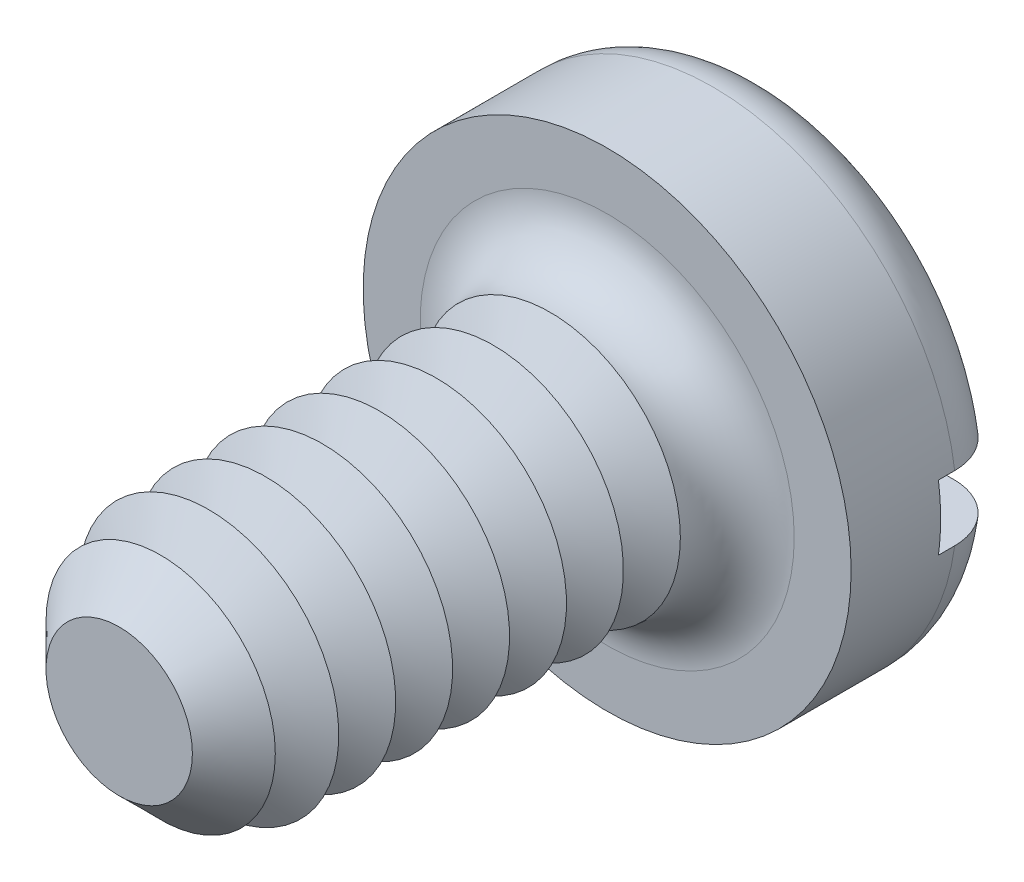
ISO-10303-21;
HEADER;
FILE_DESCRIPTION(('STEP AP214'),'2;1');
FILE_NAME('part.step','',(''),(''),'','','');
FILE_SCHEMA(('AUTOMOTIVE_DESIGN { 1 0 10303 214 1 1 1 1 }'));
ENDSEC;
DATA;
#1=APPLICATION_CONTEXT('core data for automotive mechanical design processes');
#2=APPLICATION_PROTOCOL_DEFINITION('international standard','automotive_design',2000,#1);
#3=PRODUCT_CONTEXT('',#1,'mechanical');
#4=PRODUCT('Part','Part','',(#3));
#5=PRODUCT_RELATED_PRODUCT_CATEGORY('part','',(#4));
#6=PRODUCT_DEFINITION_FORMATION('','',#4);
#7=PRODUCT_DEFINITION_CONTEXT('part definition',#1,'design');
#8=PRODUCT_DEFINITION('design','',#6,#7);
#9=PRODUCT_DEFINITION_SHAPE('','',#8);
#10=(LENGTH_UNIT() NAMED_UNIT(*) SI_UNIT(.MILLI.,.METRE.));
#11=(NAMED_UNIT(*) PLANE_ANGLE_UNIT() SI_UNIT($,.RADIAN.));
#12=(NAMED_UNIT(*) SI_UNIT($,.STERADIAN.) SOLID_ANGLE_UNIT());
#13=UNCERTAINTY_MEASURE_WITH_UNIT(LENGTH_MEASURE(1.E-05),#10,'distance_accuracy_value','');
#14=(GEOMETRIC_REPRESENTATION_CONTEXT(3) GLOBAL_UNCERTAINTY_ASSIGNED_CONTEXT((#13)) GLOBAL_UNIT_ASSIGNED_CONTEXT((#10,
#11,#12)) REPRESENTATION_CONTEXT('',''));
#15=CARTESIAN_POINT('',(0.,0.,0.));
#16=DIRECTION('',(0.,0.,1.));
#17=DIRECTION('',(1.,0.,0.));
#18=AXIS2_PLACEMENT_3D('',#15,#16,#17);
#19=CARTESIAN_POINT('',(0.,0.,-1.));
#20=DIRECTION('',(0.,0.,1.));
#21=DIRECTION('',(1.,0.,0.));
#22=AXIS2_PLACEMENT_3D('',#19,#20,#21);
#23=PLANE('',#22);
#24=CARTESIAN_POINT('',(0.,0.,-1.));
#25=DIRECTION('',(0.,0.,1.));
#26=DIRECTION('',(1.,0.,0.));
#27=AXIS2_PLACEMENT_3D('',#24,#25,#26);
#28=CIRCLE('',#27,1.15);
#29=CARTESIAN_POINT('',(-1.13247516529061,0.2,-1.));
#30=VERTEX_POINT('',#29);
#31=CARTESIAN_POINT('',(1.13247516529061,0.2,-1.));
#32=VERTEX_POINT('',#31);
#33=EDGE_CURVE('E116',#30,#32,#28,.F.);
#34=ORIENTED_EDGE('',*,*,#33,.T.);
#35=DIRECTION('',(1.,0.,0.));
#36=VECTOR('',#35,1.);
#37=CARTESIAN_POINT('',(-1.5,0.2,-1.));
#38=LINE('',#37,#36);
#39=EDGE_CURVE('E111',#30,#32,#38,.T.);
#40=ORIENTED_EDGE('',*,*,#39,.F.);
#41=EDGE_LOOP('',(#34,#40));
#42=FACE_BOUND('',#41,.T.);
#43=ADVANCED_FACE('F39',(#42),#23,.F.);
#44=CARTESIAN_POINT('',(0.,0.,-0.65));
#45=DIRECTION('',(0.,0.,1.));
#46=DIRECTION('',(1.,0.,0.));
#47=AXIS2_PLACEMENT_3D('',#44,#45,#46);
#48=TOROIDAL_SURFACE('',#47,1.15,0.35);
#49=CARTESIAN_POINT('',(-1.38697162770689,0.2,-0.89359719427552));
#50=CARTESIAN_POINT('',(-1.37305556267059,0.2,-0.907805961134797));
#51=CARTESIAN_POINT('',(-1.35791811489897,0.2,-0.9208403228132));
#52=CARTESIAN_POINT('',(-1.32565069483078,0.2,-0.944183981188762));
#53=CARTESIAN_POINT('',(-1.3085180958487,0.2,-0.954489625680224));
#54=CARTESIAN_POINT('',(-1.27278567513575,0.2,-0.972077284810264));
#55=CARTESIAN_POINT('',(-1.25418732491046,0.2,-0.979362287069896));
#56=CARTESIAN_POINT('',(-1.21604452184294,0.2,-0.990735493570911));
#57=CARTESIAN_POINT('',(-1.19650030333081,0.2,-0.994824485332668));
#58=CARTESIAN_POINT('',(-1.15682398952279,0.2,-0.99973845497));
#59=CARTESIAN_POINT('',(-1.1366881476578,0.2,-1.00053316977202));
#60=CARTESIAN_POINT('',(-1.09656272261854,0.2,-0.998770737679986));
#61=CARTESIAN_POINT('',(-1.07657315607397,0.2,-0.996213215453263));
#62=CARTESIAN_POINT('',(-1.03707277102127,0.2,-0.987780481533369));
#63=CARTESIAN_POINT('',(-1.01756977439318,0.2,-0.981868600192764));
#64=CARTESIAN_POINT('',(-0.979825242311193,0.2,-0.966867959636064));
#65=CARTESIAN_POINT('',(-0.961583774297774,0.2,-0.957779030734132));
#66=CARTESIAN_POINT('',(-0.926815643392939,0.2,-0.936628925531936));
#67=CARTESIAN_POINT('',(-0.910295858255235,0.2,-0.924556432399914));
#68=CARTESIAN_POINT('',(-0.879544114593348,0.2,-0.897781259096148));
#69=CARTESIAN_POINT('',(-0.8653120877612,0.2,-0.883078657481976));
#70=CARTESIAN_POINT('',(-0.83972745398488,0.2,-0.851619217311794));
#71=CARTESIAN_POINT('',(-0.8283448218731,0.2,-0.834886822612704));
#72=CARTESIAN_POINT('',(-0.80863848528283,0.2,-0.799707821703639));
#73=CARTESIAN_POINT('',(-0.80031425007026,0.2,-0.781261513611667));
#74=CARTESIAN_POINT('',(-0.787199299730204,0.2,-0.743695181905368));
#75=CARTESIAN_POINT('',(-0.782321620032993,0.2,-0.724605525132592));
#76=CARTESIAN_POINT('',(-0.775930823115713,0.2,-0.685871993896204));
#77=CARTESIAN_POINT('',(-0.774417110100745,0.2,-0.666228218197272));
#78=CARTESIAN_POINT('',(-0.774805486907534,0.2,-0.627456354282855));
#79=CARTESIAN_POINT('',(-0.776625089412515,0.2,-0.608327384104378));
#80=CARTESIAN_POINT('',(-0.783452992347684,0.2,-0.570648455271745));
#81=CARTESIAN_POINT('',(-0.788461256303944,0.2,-0.552098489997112));
#82=CARTESIAN_POINT('',(-0.801489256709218,0.2,-0.516098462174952));
#83=CARTESIAN_POINT('',(-0.809507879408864,0.2,-0.49864799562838));
#84=CARTESIAN_POINT('',(-0.828295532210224,0.2,-0.465297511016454));
#85=CARTESIAN_POINT('',(-0.839064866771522,0.2,-0.449397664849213));
#86=CARTESIAN_POINT('',(-0.863311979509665,0.2,-0.419196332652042));
#87=CARTESIAN_POINT('',(-0.876847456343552,0.2,-0.404941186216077));
#88=CARTESIAN_POINT('',(-0.906064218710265,0.2,-0.378832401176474));
#89=CARTESIAN_POINT('',(-0.921745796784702,0.2,-0.366979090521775));
#90=CARTESIAN_POINT('',(-0.955261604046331,0.2,-0.345690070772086));
#91=CARTESIAN_POINT('',(-0.973141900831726,0.2,-0.336326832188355));
#92=CARTESIAN_POINT('',(-1.01020647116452,0.2,-0.320690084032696));
#93=CARTESIAN_POINT('',(-1.02939085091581,0.2,-0.314416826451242));
#94=CARTESIAN_POINT('',(-1.06878849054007,0.2,-0.305073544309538));
#95=CARTESIAN_POINT('',(-1.0890118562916,0.2,-0.302046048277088));
#96=CARTESIAN_POINT('',(-1.12968032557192,0.2,-0.299436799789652));
#97=CARTESIAN_POINT('',(-1.15012542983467,0.2,-0.299855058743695));
#98=CARTESIAN_POINT('',(-1.1906059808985,0.2,-0.304138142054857));
#99=CARTESIAN_POINT('',(-1.21064224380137,0.2,-0.307995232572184));
#100=CARTESIAN_POINT('',(-1.24976957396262,0.2,-0.319055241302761));
#101=CARTESIAN_POINT('',(-1.26886068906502,0.2,-0.326257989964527));
#102=CARTESIAN_POINT('',(-1.30533597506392,0.2,-0.343725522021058));
#103=CARTESIAN_POINT('',(-1.32273620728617,0.2,-0.353956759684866));
#104=CARTESIAN_POINT('',(-1.35554323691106,0.2,-0.377229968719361));
#105=CARTESIAN_POINT('',(-1.37095016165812,0.2,-0.390271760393));
#106=CARTESIAN_POINT('',(-1.39913145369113,0.2,-0.418621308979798));
#107=CARTESIAN_POINT('',(-1.41193602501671,0.2,-0.43389904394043));
#108=CARTESIAN_POINT('',(-1.43476712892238,0.2,-0.46640589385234));
#109=CARTESIAN_POINT('',(-1.44479381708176,0.2,-0.483634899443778));
#110=CARTESIAN_POINT('',(-1.4616814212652,0.2,-0.519367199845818));
#111=CARTESIAN_POINT('',(-1.46857323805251,0.2,-0.537855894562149));
#112=CARTESIAN_POINT('',(-1.4791331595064,0.2,-0.575731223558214));
#113=CARTESIAN_POINT('',(-1.48280152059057,0.2,-0.595117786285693));
#114=CARTESIAN_POINT('',(-1.4867930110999,0.2,-0.634109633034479));
#115=CARTESIAN_POINT('',(-1.48713684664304,0.2,-0.653712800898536));
#116=CARTESIAN_POINT('',(-1.48452244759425,0.2,-0.692702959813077));
#117=CARTESIAN_POINT('',(-1.48156342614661,0.2,-0.712089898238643));
#118=CARTESIAN_POINT('',(-1.47243636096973,0.2,-0.75006822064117));
#119=CARTESIAN_POINT('',(-1.46627182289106,0.2,-0.768660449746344));
#120=CARTESIAN_POINT('',(-1.45092056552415,0.2,-0.804533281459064));
#121=CARTESIAN_POINT('',(-1.44173755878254,0.2,-0.821815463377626));
#122=CARTESIAN_POINT('',(-1.42477940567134,0.2,-0.848152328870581));
#123=CARTESIAN_POINT('',(-1.41786672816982,0.2,-0.857773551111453));
#124=CARTESIAN_POINT('',(-1.40310412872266,0.2,-0.876267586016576));
#125=CARTESIAN_POINT('',(-1.39525421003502,0.2,-0.885140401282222));
#126=CARTESIAN_POINT('',(-1.38697162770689,0.2,-0.89359719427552));
#127=B_SPLINE_CURVE_WITH_KNOTS('',3,(#49,#50,#51,#52,#53,#54,#55,#56,#57,#58,#59,#60,#61,#62,
#63,#64,#65,#66,#67,#68,#69,#70,#71,#72,#73,#74,#75,#76,#77,#78,#79,#80,#81,#82,#83,#84,#85,#86,
#87,#88,#89,#90,#91,#92,#93,#94,#95,#96,#97,#98,#99,#100,#101,#102,#103,#104,#105,#106,#107,
#108,#109,#110,#111,#112,#113,#114,#115,#116,#117,#118,#119,#120,#121,#122,#123,#124,#125,#126),
.UNSPECIFIED.,.T.,.F.,(4,2,2,2,2,2,2,2,2,2,2,2,2,2,2,2,2,2,2,2,2,2,2,2,2,2,2,2,2,2,2,2,2,2,2,2,
2,2,4),(0.,0.0596211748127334,0.119321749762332,0.178963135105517,0.238589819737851,
0.298763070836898,0.358943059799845,0.419793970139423,0.48064813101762,0.541736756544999,
0.602823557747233,0.663236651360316,0.72363925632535,0.782457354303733,0.841265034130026,
0.898637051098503,0.956008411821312,1.01335856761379,1.07071507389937,1.12941939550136,
1.18813172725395,1.24840147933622,1.30867614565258,1.36973127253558,1.43078660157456,
1.49170496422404,1.55262023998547,1.61288453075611,1.67314496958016,1.73266007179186,
1.792171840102,1.85108355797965,1.90999058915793,1.96853049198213,2.02708434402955,
2.08557429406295,2.14399257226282,2.17947810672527,2.21496351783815),.UNSPECIFIED.);
#128=CARTESIAN_POINT('',(-1.48660687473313,0.2,-0.649999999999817));
#129=VERTEX_POINT('',#128);
#130=EDGE_CURVE('E240',#129,#30,#127,.T.);
#131=ORIENTED_EDGE('',*,*,#130,.F.);
#132=CARTESIAN_POINT('',(0.,0.,-0.65));
#133=DIRECTION('',(0.,0.,1.));
#134=DIRECTION('',(1.,0.,0.));
#135=AXIS2_PLACEMENT_3D('',#132,#133,#134);
#136=CIRCLE('',#135,1.5);
#137=CARTESIAN_POINT('',(1.48660687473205,0.2,-0.649999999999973));
#138=VERTEX_POINT('',#137);
#139=EDGE_CURVE('E124',#138,#129,#136,.T.);
#140=ORIENTED_EDGE('',*,*,#139,.F.);
#141=CARTESIAN_POINT('',(0.780520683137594,0.2,-0.713112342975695));
#142=CARTESIAN_POINT('',(0.784146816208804,0.2,-0.73226748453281));
#143=CARTESIAN_POINT('',(0.789425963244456,0.2,-0.751125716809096));
#144=CARTESIAN_POINT('',(0.803106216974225,0.2,-0.78769198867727));
#145=CARTESIAN_POINT('',(0.811511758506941,0.2,-0.805398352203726));
#146=CARTESIAN_POINT('',(0.831144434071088,0.2,-0.839131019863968));
#147=CARTESIAN_POINT('',(0.842366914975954,0.2,-0.855160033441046));
#148=CARTESIAN_POINT('',(0.867288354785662,0.2,-0.88515062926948));
#149=CARTESIAN_POINT('',(0.880986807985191,0.2,-0.899112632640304));
#150=CARTESIAN_POINT('',(0.910770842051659,0.2,-0.924888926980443));
#151=CARTESIAN_POINT('',(0.926899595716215,0.2,-0.936653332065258));
#152=CARTESIAN_POINT('',(0.960871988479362,0.2,-0.957372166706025));
#153=CARTESIAN_POINT('',(0.978715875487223,0.2,-0.966326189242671));
#154=CARTESIAN_POINT('',(1.01600338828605,0.2,-0.981340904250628));
#155=CARTESIAN_POINT('',(1.03547204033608,0.2,-0.987339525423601));
#156=CARTESIAN_POINT('',(1.07513874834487,0.2,-0.995998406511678));
#157=CARTESIAN_POINT('',(1.09533683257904,0.2,-0.998658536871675));
#158=CARTESIAN_POINT('',(1.1359751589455,0.2,-1.0005575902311));
#159=CARTESIAN_POINT('',(1.1564160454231,0.2,-0.99978283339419));
#160=CARTESIAN_POINT('',(1.19687229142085,0.2,-0.994784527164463));
#161=CARTESIAN_POINT('',(1.21688766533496,0.2,-0.990561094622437));
#162=CARTESIAN_POINT('',(1.25575385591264,0.2,-0.978813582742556));
#163=CARTESIAN_POINT('',(1.27461259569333,0.2,-0.971315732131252));
#164=CARTESIAN_POINT('',(1.31078063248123,0.2,-0.953221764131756));
#165=CARTESIAN_POINT('',(1.32809002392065,0.2,-0.942625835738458));
#166=CARTESIAN_POINT('',(1.36044102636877,0.2,-0.918776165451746));
#167=CARTESIAN_POINT('',(1.37550786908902,0.2,-0.905556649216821));
#168=CARTESIAN_POINT('',(1.40317627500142,0.2,-0.876749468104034));
#169=CARTESIAN_POINT('',(1.41577799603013,0.2,-0.861161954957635));
#170=CARTESIAN_POINT('',(1.43800830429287,0.2,-0.828254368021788));
#171=CARTESIAN_POINT('',(1.44766923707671,0.2,-0.810956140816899));
#172=CARTESIAN_POINT('',(1.46392269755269,0.2,-0.774973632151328));
#173=CARTESIAN_POINT('',(1.4705153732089,0.2,-0.756289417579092));
#174=CARTESIAN_POINT('',(1.48039453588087,0.2,-0.718226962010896));
#175=CARTESIAN_POINT('',(1.48370713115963,0.2,-0.69885549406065));
#176=CARTESIAN_POINT('',(1.48701993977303,0.2,-0.659831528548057));
#177=CARTESIAN_POINT('',(1.4870202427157,0.2,-0.640179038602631));
#178=CARTESIAN_POINT('',(1.48371470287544,0.2,-0.6012267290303));
#179=CARTESIAN_POINT('',(1.48042091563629,0.2,-0.581925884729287));
#180=CARTESIAN_POINT('',(1.47064268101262,0.2,-0.544150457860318));
#181=CARTESIAN_POINT('',(1.46415824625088,0.2,-0.525675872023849));
#182=CARTESIAN_POINT('',(1.4481813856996,0.2,-0.490055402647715));
#183=CARTESIAN_POINT('',(1.43868601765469,0.2,-0.472910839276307));
#184=CARTESIAN_POINT('',(1.41696658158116,0.2,-0.440447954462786));
#185=CARTESIAN_POINT('',(1.40474246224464,0.2,-0.425129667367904));
#186=CARTESIAN_POINT('',(1.37784446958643,0.2,-0.39666049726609));
#187=CARTESIAN_POINT('',(1.36315749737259,0.2,-0.383521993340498));
#188=CARTESIAN_POINT('',(1.33180407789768,0.2,-0.359869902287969));
#189=CARTESIAN_POINT('',(1.31513754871,0.2,-0.349356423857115));
#190=CARTESIAN_POINT('',(1.28013085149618,0.2,-0.331143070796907));
#191=CARTESIAN_POINT('',(1.26177629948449,0.2,-0.323470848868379));
#192=CARTESIAN_POINT('',(1.224049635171,0.2,-0.311275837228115));
#193=CARTESIAN_POINT('',(1.20467746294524,0.2,-0.306753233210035));
#194=CARTESIAN_POINT('',(1.1652160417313,0.2,-0.300927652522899));
#195=CARTESIAN_POINT('',(1.14512096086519,0.2,-0.299664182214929));
#196=CARTESIAN_POINT('',(1.10499953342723,0.2,-0.300488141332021));
#197=CARTESIAN_POINT('',(1.08497319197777,0.2,-0.302575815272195));
#198=CARTESIAN_POINT('',(1.04531606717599,0.2,-0.310075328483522));
#199=CARTESIAN_POINT('',(1.0256923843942,0.2,-0.315524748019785));
#200=CARTESIAN_POINT('',(0.987629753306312,0.2,-0.329624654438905));
#201=CARTESIAN_POINT('',(0.96919087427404,0.2,-0.338275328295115));
#202=CARTESIAN_POINT('',(0.933939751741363,0.2,-0.358590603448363));
#203=CARTESIAN_POINT('',(0.917135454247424,0.2,-0.370269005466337));
#204=CARTESIAN_POINT('',(0.88574931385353,0.2,-0.396306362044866));
#205=CARTESIAN_POINT('',(0.87116734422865,0.2,-0.410665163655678));
#206=CARTESIAN_POINT('',(0.844813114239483,0.2,-0.441518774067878));
#207=CARTESIAN_POINT('',(0.833014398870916,0.2,-0.457990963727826));
#208=CARTESIAN_POINT('',(0.812431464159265,0.2,-0.492729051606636));
#209=CARTESIAN_POINT('',(0.803647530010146,0.2,-0.510995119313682));
#210=CARTESIAN_POINT('',(0.789590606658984,0.2,-0.548308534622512));
#211=CARTESIAN_POINT('',(0.784235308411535,0.2,-0.5673249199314));
#212=CARTESIAN_POINT('',(0.7768953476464,0.2,-0.605979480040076));
#213=CARTESIAN_POINT('',(0.774905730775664,0.2,-0.625616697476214));
#214=CARTESIAN_POINT('',(0.774470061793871,0.2,-0.656633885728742));
#215=CARTESIAN_POINT('',(0.7748847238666,0.2,-0.668009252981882));
#216=CARTESIAN_POINT('',(0.776852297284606,0.2,-0.690660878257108));
#217=CARTESIAN_POINT('',(0.77840517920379,0.2,-0.701937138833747));
#218=CARTESIAN_POINT('',(0.780520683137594,0.2,-0.713112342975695));
#219=B_SPLINE_CURVE_WITH_KNOTS('',3,(#141,#142,#143,#144,#145,#146,#147,#148,#149,#150,#151,
#152,#153,#154,#155,#156,#157,#158,#159,#160,#161,#162,#163,#164,#165,#166,#167,#168,#169,#170,
#171,#172,#173,#174,#175,#176,#177,#178,#179,#180,#181,#182,#183,#184,#185,#186,#187,#188,#189,
#190,#191,#192,#193,#194,#195,#196,#197,#198,#199,#200,#201,#202,#203,#204,#205,#206,#207,#208,
#209,#210,#211,#212,#213,#214,#215,#216,#217,#218),.UNSPECIFIED.,.T.,.F.,(4,2,2,2,2,2,2,2,2,2,2,
2,2,2,2,2,2,2,2,2,2,2,2,2,2,2,2,2,2,2,2,2,2,2,2,2,2,2,4),(0.,0.0584431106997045,
0.11696944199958,0.175399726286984,0.233818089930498,0.293433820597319,0.353058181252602,
0.413886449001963,0.474717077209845,0.53579018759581,0.596861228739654,0.65745180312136,
0.718038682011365,0.777881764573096,0.837721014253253,0.896876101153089,0.95602833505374,
1.01470585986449,1.07338179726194,1.13184377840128,1.19030552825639,1.24882458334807,
1.30734473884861,1.36618662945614,1.42503095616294,1.48443380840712,1.54384016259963,
1.60396331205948,1.66409084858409,1.72490303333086,1.78571877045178,1.84681674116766,
1.90791122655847,1.96839922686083,2.02889294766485,2.08787382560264,2.14676780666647,
2.18086468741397,2.21496068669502),.UNSPECIFIED.);
#220=EDGE_CURVE('E242',#32,#138,#219,.T.);
#221=ORIENTED_EDGE('',*,*,#220,.F.);
#222=ORIENTED_EDGE('',*,*,#33,.F.);
#223=EDGE_LOOP('',(#131,#140,#221,#222));
#224=FACE_BOUND('',#223,.T.);
#225=ADVANCED_FACE('F224',(#224),#48,.T.);
#226=CARTESIAN_POINT('',(0.,0.,-1.));
#227=DIRECTION('',(0.,0.,1.));
#228=DIRECTION('',(1.,0.,0.));
#229=AXIS2_PLACEMENT_3D('',#226,#227,#228);
#230=CYLINDRICAL_SURFACE('',#229,1.5);
#231=DIRECTION('',(0.,0.,1.));
#232=VECTOR('',#231,1.);
#233=CARTESIAN_POINT('',(1.48660687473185,0.2,-1.));
#234=LINE('',#233,#232);
#235=CARTESIAN_POINT('',(1.48660687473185,0.2,-0.55));
#236=VERTEX_POINT('',#235);
#237=EDGE_CURVE('E258',#138,#236,#234,.T.);
#238=ORIENTED_EDGE('',*,*,#237,.F.);
#239=ORIENTED_EDGE('',*,*,#139,.T.);
#240=DIRECTION('',(0.,0.,1.));
#241=VECTOR('',#240,1.);
#242=CARTESIAN_POINT('',(-1.48660687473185,0.2,-1.));
#243=LINE('',#242,#241);
#244=CARTESIAN_POINT('',(-1.48660687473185,0.2,-0.55));
#245=VERTEX_POINT('',#244);
#246=EDGE_CURVE('E63',#245,#129,#243,.F.);
#247=ORIENTED_EDGE('',*,*,#246,.F.);
#248=CARTESIAN_POINT('',(0.,0.,-0.55));
#249=DIRECTION('',(0.,0.,-1.));
#250=DIRECTION('',(-1.,0.,0.));
#251=AXIS2_PLACEMENT_3D('',#248,#249,#250);
#252=CIRCLE('',#251,1.5);
#253=CARTESIAN_POINT('',(-1.48660687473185,-0.2,-0.55));
#254=VERTEX_POINT('',#253);
#255=EDGE_CURVE('E43',#245,#254,#252,.F.);
#256=ORIENTED_EDGE('',*,*,#255,.T.);
#257=DIRECTION('',(0.,0.,1.));
#258=VECTOR('',#257,1.);
#259=CARTESIAN_POINT('',(-1.48660687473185,-0.2,-1.));
#260=LINE('',#259,#258);
#261=CARTESIAN_POINT('',(-1.48660687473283,-0.2,-0.650000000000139));
#262=VERTEX_POINT('',#261);
#263=EDGE_CURVE('E255',#262,#254,#260,.T.);
#264=ORIENTED_EDGE('',*,*,#263,.F.);
#265=CARTESIAN_POINT('',(1.48660687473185,-0.2,-0.65));
#266=VERTEX_POINT('',#265);
#267=EDGE_CURVE('E126',#262,#266,#136,.T.);
#268=ORIENTED_EDGE('',*,*,#267,.T.);
#269=DIRECTION('',(0.,0.,1.));
#270=VECTOR('',#269,1.);
#271=CARTESIAN_POINT('',(1.48660687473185,-0.2,-1.));
#272=LINE('',#271,#270);
#273=CARTESIAN_POINT('',(1.48660687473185,-0.2,-0.55));
#274=VERTEX_POINT('',#273);
#275=EDGE_CURVE('E55',#274,#266,#272,.F.);
#276=ORIENTED_EDGE('',*,*,#275,.F.);
#277=EDGE_CURVE('E11',#274,#236,#252,.F.);
#278=ORIENTED_EDGE('',*,*,#277,.T.);
#279=EDGE_LOOP('',(#238,#239,#247,#256,#264,#268,#276,#278));
#280=FACE_BOUND('',#279,.T.);
#281=CARTESIAN_POINT('',(0.,0.,0.));
#282=DIRECTION('',(0.,0.,1.));
#283=DIRECTION('',(1.,0.,0.));
#284=AXIS2_PLACEMENT_3D('',#281,#282,#283);
#285=CIRCLE('',#284,1.5);
#286=CARTESIAN_POINT('',(1.5,0.,0.));
#287=VERTEX_POINT('',#286);
#288=EDGE_CURVE('E261',#287,#287,#285,.T.);
#289=ORIENTED_EDGE('',*,*,#288,.F.);
#290=EDGE_LOOP('',(#289));
#291=FACE_BOUND('',#290,.T.);
#292=ADVANCED_FACE('F220',(#280,#291),#230,.T.);
#293=CARTESIAN_POINT('',(1.13247516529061,-0.2,-1.));
#294=VERTEX_POINT('',#293);
#295=CARTESIAN_POINT('',(-1.13247516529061,-0.2,-1.));
#296=VERTEX_POINT('',#295);
#297=EDGE_CURVE('E109',#294,#296,#28,.F.);
#298=ORIENTED_EDGE('',*,*,#297,.T.);
#299=DIRECTION('',(-1.,0.,0.));
#300=VECTOR('',#299,1.);
#301=CARTESIAN_POINT('',(-1.5,-0.2,-1.));
#302=LINE('',#301,#300);
#303=EDGE_CURVE('E96',#294,#296,#302,.T.);
#304=ORIENTED_EDGE('',*,*,#303,.F.);
#305=EDGE_LOOP('',(#298,#304));
#306=FACE_BOUND('',#305,.T.);
#307=ADVANCED_FACE('F108',(#306),#23,.F.);
#308=CARTESIAN_POINT('',(0.,0.,0.));
#309=DIRECTION('',(0.,0.,1.));
#310=DIRECTION('',(1.,0.,0.));
#311=AXIS2_PLACEMENT_3D('',#308,#309,#310);
#312=PLANE('',#311);
#313=CARTESIAN_POINT('',(0.,0.,0.));
#314=DIRECTION('',(0.,0.,1.));
#315=DIRECTION('',(1.,0.,0.));
#316=AXIS2_PLACEMENT_3D('',#313,#314,#315);
#317=CIRCLE('',#316,1.15);
#318=CARTESIAN_POINT('',(1.15,0.,0.));
#319=VERTEX_POINT('',#318);
#320=EDGE_CURVE('E115',#319,#319,#317,.F.);
#321=ORIENTED_EDGE('',*,*,#320,.T.);
#322=EDGE_LOOP('',(#321));
#323=FACE_BOUND('',#322,.T.);
#324=ORIENTED_EDGE('',*,*,#288,.T.);
#325=EDGE_LOOP('',(#324));
#326=FACE_BOUND('',#325,.T.);
#327=ADVANCED_FACE('F219',(#323,#326),#312,.T.);
#328=CARTESIAN_POINT('',(-1.38697162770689,-0.2,-0.89359719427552));
#329=CARTESIAN_POINT('',(-1.40068341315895,-0.2,-0.87959447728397));
#330=CARTESIAN_POINT('',(-1.41322919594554,-0.2,-0.864431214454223));
#331=CARTESIAN_POINT('',(-1.43561095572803,-0.2,-0.83220389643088));
#332=CARTESIAN_POINT('',(-1.44544396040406,-0.2,-0.815137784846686));
#333=CARTESIAN_POINT('',(-1.46209732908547,-0.2,-0.779595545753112));
#334=CARTESIAN_POINT('',(-1.46891825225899,-0.2,-0.761119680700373));
#335=CARTESIAN_POINT('',(-1.479344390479,-0.2,-0.723286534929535));
#336=CARTESIAN_POINT('',(-1.48295036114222,-0.2,-0.703929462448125));
#337=CARTESIAN_POINT('',(-1.48683413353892,-0.2,-0.6649653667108));
#338=CARTESIAN_POINT('',(-1.48712565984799,-0.2,-0.645359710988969));
#339=CARTESIAN_POINT('',(-1.48440736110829,-0.2,-0.606378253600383));
#340=CARTESIAN_POINT('',(-1.48139747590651,-0.2,-0.587002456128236));
#341=CARTESIAN_POINT('',(-1.47217267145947,-0.2,-0.549061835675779));
#342=CARTESIAN_POINT('',(-1.46596274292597,-0.2,-0.530495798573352));
#343=CARTESIAN_POINT('',(-1.45052327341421,-0.2,-0.494665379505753));
#344=CARTESIAN_POINT('',(-1.44129371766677,-0.2,-0.477401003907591));
#345=CARTESIAN_POINT('',(-1.42005139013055,-0.2,-0.444603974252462));
#346=CARTESIAN_POINT('',(-1.40803014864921,-0.2,-0.429076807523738));
#347=CARTESIAN_POINT('',(-1.38156905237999,-0.2,-0.400242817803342));
#348=CARTESIAN_POINT('',(-1.36712913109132,-0.2,-0.386936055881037));
#349=CARTESIAN_POINT('',(-1.33612890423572,-0.2,-0.362811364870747));
#350=CARTESIAN_POINT('',(-1.31955365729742,-0.2,-0.352012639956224));
#351=CARTESIAN_POINT('',(-1.28484098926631,-0.2,-0.333316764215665));
#352=CARTESIAN_POINT('',(-1.26670348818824,-0.2,-0.325419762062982));
#353=CARTESIAN_POINT('',(-1.22917040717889,-0.2,-0.31265726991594));
#354=CARTESIAN_POINT('',(-1.20976324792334,-0.2,-0.3078258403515));
#355=CARTESIAN_POINT('',(-1.17041685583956,-0.2,-0.30144641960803));
#356=CARTESIAN_POINT('',(-1.15047758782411,-0.2,-0.299898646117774));
#357=CARTESIAN_POINT('',(-1.11037109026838,-0.2,-0.300112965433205));
#358=CARTESIAN_POINT('',(-1.09020407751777,-0.2,-0.301916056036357));
#359=CARTESIAN_POINT('',(-1.05044996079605,-0.2,-0.308849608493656));
#360=CARTESIAN_POINT('',(-1.03086289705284,-0.2,-0.313980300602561));
#361=CARTESIAN_POINT('',(-0.992636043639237,-0.2,-0.327485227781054));
#362=CARTESIAN_POINT('',(-0.974006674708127,-0.2,-0.335888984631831));
#363=CARTESIAN_POINT('',(-0.938423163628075,-0.2,-0.355707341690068));
#364=CARTESIAN_POINT('',(-0.921469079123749,-0.2,-0.367122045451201));
#365=CARTESIAN_POINT('',(-0.889752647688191,-0.2,-0.392642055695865));
#366=CARTESIAN_POINT('',(-0.874987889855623,-0.2,-0.406744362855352));
#367=CARTESIAN_POINT('',(-0.848085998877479,-0.2,-0.437266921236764));
#368=CARTESIAN_POINT('',(-0.835948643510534,-0.2,-0.453686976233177));
#369=CARTESIAN_POINT('',(-0.814894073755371,-0.2,-0.488078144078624));
#370=CARTESIAN_POINT('',(-0.805923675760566,-0.2,-0.506016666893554));
#371=CARTESIAN_POINT('',(-0.791223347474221,-0.2,-0.543175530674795));
#372=CARTESIAN_POINT('',(-0.78549275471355,-0.2,-0.562395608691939));
#373=CARTESIAN_POINT('',(-0.777599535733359,-0.2,-0.600984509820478));
#374=CARTESIAN_POINT('',(-0.775340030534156,-0.2,-0.62033354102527));
#375=CARTESIAN_POINT('',(-0.774164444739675,-0.2,-0.659131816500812));
#376=CARTESIAN_POINT('',(-0.775247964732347,-0.2,-0.678581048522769));
#377=CARTESIAN_POINT('',(-0.78067015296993,-0.2,-0.716679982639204));
#378=CARTESIAN_POINT('',(-0.784953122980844,-0.2,-0.735337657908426));
#379=CARTESIAN_POINT('',(-0.796558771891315,-0.2,-0.771681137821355));
#380=CARTESIAN_POINT('',(-0.803881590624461,-0.2,-0.789366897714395));
#381=CARTESIAN_POINT('',(-0.821417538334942,-0.2,-0.823475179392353));
#382=CARTESIAN_POINT('',(-0.831660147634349,-0.2,-0.839882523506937));
#383=CARTESIAN_POINT('',(-0.854684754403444,-0.2,-0.870805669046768));
#384=CARTESIAN_POINT('',(-0.867467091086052,-0.2,-0.885321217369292));
#385=CARTESIAN_POINT('',(-0.895584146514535,-0.2,-0.912470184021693));
#386=CARTESIAN_POINT('',(-0.910979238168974,-0.2,-0.925041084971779));
#387=CARTESIAN_POINT('',(-0.943622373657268,-0.2,-0.947488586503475));
#388=CARTESIAN_POINT('',(-0.960870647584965,-0.2,-0.957364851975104));
#389=CARTESIAN_POINT('',(-0.997151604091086,-0.2,-0.974359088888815));
#390=CARTESIAN_POINT('',(-1.01621564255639,-0.2,-0.98141019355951));
#391=CARTESIAN_POINT('',(-1.05525219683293,-0.2,-0.992235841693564));
#392=CARTESIAN_POINT('',(-1.07522472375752,-0.2,-0.996010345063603));
#393=CARTESIAN_POINT('',(-1.11565152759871,-0.2,-1.00018247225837));
#394=CARTESIAN_POINT('',(-1.1361080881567,-0.2,-1.00055804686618));
#395=CARTESIAN_POINT('',(-1.17679659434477,-0.2,-0.997846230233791));
#396=CARTESIAN_POINT('',(-1.19702848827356,-0.2,-0.994758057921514));
#397=CARTESIAN_POINT('',(-1.23655375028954,-0.2,-0.985216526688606));
#398=CARTESIAN_POINT('',(-1.25585198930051,-0.2,-0.978783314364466));
#399=CARTESIAN_POINT('',(-1.29305658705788,-0.2,-0.962732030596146));
#400=CARTESIAN_POINT('',(-1.31096467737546,-0.2,-0.953118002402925));
#401=CARTESIAN_POINT('',(-1.33859353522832,-0.2,-0.935076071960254));
#402=CARTESIAN_POINT('',(-1.34889525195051,-0.2,-0.927521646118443));
#403=CARTESIAN_POINT('',(-1.36861998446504,-0.2,-0.911341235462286));
#404=CARTESIAN_POINT('',(-1.37804300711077,-0.2,-0.90271525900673));
#405=CARTESIAN_POINT('',(-1.38697162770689,-0.2,-0.89359719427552));
#406=B_SPLINE_CURVE_WITH_KNOTS('',3,(#328,#329,#330,#331,#332,#333,#334,#335,#336,#337,#338,
#339,#340,#341,#342,#343,#344,#345,#346,#347,#348,#349,#350,#351,#352,#353,#354,#355,#356,#357,
#358,#359,#360,#361,#362,#363,#364,#365,#366,#367,#368,#369,#370,#371,#372,#373,#374,#375,#376,
#377,#378,#379,#380,#381,#382,#383,#384,#385,#386,#387,#388,#389,#390,#391,#392,#393,#394,#395,
#396,#397,#398,#399,#400,#401,#402,#403,#404,#405),.UNSPECIFIED.,.T.,.F.,(4,2,2,2,2,2,2,2,2,2,2,
2,2,2,2,2,2,2,2,2,2,2,2,2,2,2,2,2,2,2,2,2,2,2,2,2,2,2,4),(0.,0.0587484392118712,
0.117560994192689,0.17636262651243,0.235150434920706,0.293694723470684,0.352240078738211,
0.410694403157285,0.46914901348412,0.527783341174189,0.586419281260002,0.645490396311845,
0.704564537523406,0.76428403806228,0.824007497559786,0.884466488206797,0.944929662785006,
1.00595131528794,1.06697506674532,1.12793111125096,1.18888199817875,1.2487542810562,
1.30861431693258,1.36677117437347,1.4249210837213,1.48208160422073,1.53924475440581,
1.59700685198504,1.65477666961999,1.71413044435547,1.77349159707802,1.83418476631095,
1.89487867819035,1.95596603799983,2.01706717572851,2.07780450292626,2.13846491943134,
2.17672008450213,2.21497495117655),.UNSPECIFIED.);
#407=EDGE_CURVE('E103',#296,#262,#406,.T.);
#408=ORIENTED_EDGE('',*,*,#407,.F.);
#409=ORIENTED_EDGE('',*,*,#297,.F.);
#410=CARTESIAN_POINT('',(0.780520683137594,-0.2,-0.713112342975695));
#411=CARTESIAN_POINT('',(0.776967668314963,-0.2,-0.694332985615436));
#412=CARTESIAN_POINT('',(0.774997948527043,-0.2,-0.675240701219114));
#413=CARTESIAN_POINT('',(0.774305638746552,-0.2,-0.636983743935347));
#414=CARTESIAN_POINT('',(0.775586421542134,-0.2,-0.617819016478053));
#415=CARTESIAN_POINT('',(0.781350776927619,-0.2,-0.579992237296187));
#416=CARTESIAN_POINT('',(0.78583187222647,-0.2,-0.56132980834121));
#417=CARTESIAN_POINT('',(0.797836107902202,-0.2,-0.525016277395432));
#418=CARTESIAN_POINT('',(0.805358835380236,-0.2,-0.507365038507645));
#419=CARTESIAN_POINT('',(0.823276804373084,-0.2,-0.47338978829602));
#420=CARTESIAN_POINT('',(0.833696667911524,-0.2,-0.457078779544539));
#421=CARTESIAN_POINT('',(0.857057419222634,-0.2,-0.426375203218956));
#422=CARTESIAN_POINT('',(0.869998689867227,-0.2,-0.411982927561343));
#423=CARTESIAN_POINT('',(0.898418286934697,-0.2,-0.38510575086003));
#424=CARTESIAN_POINT('',(0.913956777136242,-0.2,-0.372684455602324));
#425=CARTESIAN_POINT('',(0.946860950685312,-0.2,-0.350558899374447));
#426=CARTESIAN_POINT('',(0.964226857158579,-0.2,-0.340854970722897));
#427=CARTESIAN_POINT('',(1.00070854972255,-0.2,-0.324232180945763));
#428=CARTESIAN_POINT('',(1.01985442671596,-0.2,-0.317379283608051));
#429=CARTESIAN_POINT('',(1.0590214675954,-0.2,-0.306962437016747));
#430=CARTESIAN_POINT('',(1.07904267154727,-0.2,-0.303398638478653));
#431=CARTESIAN_POINT('',(1.11952320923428,-0.2,-0.299657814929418));
#432=CARTESIAN_POINT('',(1.13998446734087,-0.2,-0.299501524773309));
#433=CARTESIAN_POINT('',(1.1806395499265,-0.2,-0.302650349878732));
#434=CARTESIAN_POINT('',(1.20083338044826,-0.2,-0.305955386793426));
#435=CARTESIAN_POINT('',(1.24023260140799,-0.2,-0.315918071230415));
#436=CARTESIAN_POINT('',(1.25944372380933,-0.2,-0.322553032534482));
#437=CARTESIAN_POINT('',(1.29645854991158,-0.2,-0.338992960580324));
#438=CARTESIAN_POINT('',(1.31426233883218,-0.2,-0.348797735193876));
#439=CARTESIAN_POINT('',(1.34772734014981,-0.2,-0.371172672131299));
#440=CARTESIAN_POINT('',(1.36341179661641,-0.2,-0.383708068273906));
#441=CARTESIAN_POINT('',(1.39242189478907,-0.2,-0.41126267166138));
#442=CARTESIAN_POINT('',(1.40574768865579,-0.2,-0.426281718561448));
#443=CARTESIAN_POINT('',(1.42949833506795,-0.2,-0.458186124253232));
#444=CARTESIAN_POINT('',(1.43995542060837,-0.2,-0.475047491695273));
#445=CARTESIAN_POINT('',(1.45786189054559,-0.2,-0.510298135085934));
#446=CARTESIAN_POINT('',(1.46531142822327,-0.2,-0.528687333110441));
#447=CARTESIAN_POINT('',(1.47692889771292,-0.2,-0.566301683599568));
#448=CARTESIAN_POINT('',(1.48112438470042,-0.2,-0.585518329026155));
#449=CARTESIAN_POINT('',(1.48621428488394,-0.2,-0.624383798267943));
#450=CARTESIAN_POINT('',(1.48710879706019,-0.2,-0.644032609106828));
#451=CARTESIAN_POINT('',(1.48557356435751,-0.2,-0.683115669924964));
#452=CARTESIAN_POINT('',(1.48315796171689,-0.2,-0.702550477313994));
#453=CARTESIAN_POINT('',(1.47509909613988,-0.2,-0.740738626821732));
#454=CARTESIAN_POINT('',(1.46945585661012,-0.2,-0.759491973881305));
#455=CARTESIAN_POINT('',(1.45510530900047,-0.2,-0.79579446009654));
#456=CARTESIAN_POINT('',(1.44639690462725,-0.2,-0.813343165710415));
#457=CARTESIAN_POINT('',(1.42617120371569,-0.2,-0.846738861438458));
#458=CARTESIAN_POINT('',(1.41465386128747,-0.2,-0.862585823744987));
#459=CARTESIAN_POINT('',(1.3890808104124,-0.2,-0.892214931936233));
#460=CARTESIAN_POINT('',(1.37501291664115,-0.2,-0.90598655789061));
#461=CARTESIAN_POINT('',(1.34478283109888,-0.2,-0.930997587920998));
#462=CARTESIAN_POINT('',(1.32862056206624,-0.2,-0.942236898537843));
#463=CARTESIAN_POINT('',(1.29450693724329,-0.2,-0.96197581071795));
#464=CARTESIAN_POINT('',(1.27654077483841,-0.2,-0.970449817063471));
#465=CARTESIAN_POINT('',(1.23945233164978,-0.2,-0.984300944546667));
#466=CARTESIAN_POINT('',(1.2203299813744,-0.2,-0.989677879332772));
#467=CARTESIAN_POINT('',(1.18123021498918,-0.2,-0.997250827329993));
#468=CARTESIAN_POINT('',(1.16124534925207,-0.2,-0.999408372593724));
#469=CARTESIAN_POINT('',(1.12119456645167,-0.2,-1.00037966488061));
#470=CARTESIAN_POINT('',(1.10112864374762,-0.2,-0.999193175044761));
#471=CARTESIAN_POINT('',(1.06123417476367,-0.2,-0.993489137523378));
#472=CARTESIAN_POINT('',(1.0414112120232,-0.2,-0.988932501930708));
#473=CARTESIAN_POINT('',(1.00280276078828,-0.2,-0.976576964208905));
#474=CARTESIAN_POINT('',(0.984017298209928,-0.2,-0.968777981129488));
#475=CARTESIAN_POINT('',(0.947906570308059,-0.2,-0.95009587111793));
#476=CARTESIAN_POINT('',(0.930590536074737,-0.2,-0.939194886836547));
#477=CARTESIAN_POINT('',(0.89804559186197,-0.2,-0.914617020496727));
#478=CARTESIAN_POINT('',(0.882817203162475,-0.2,-0.900939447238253));
#479=CARTESIAN_POINT('',(0.855020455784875,-0.2,-0.871287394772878));
#480=CARTESIAN_POINT('',(0.84243415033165,-0.2,-0.855329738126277));
#481=CARTESIAN_POINT('',(0.820210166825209,-0.2,-0.821497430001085));
#482=CARTESIAN_POINT('',(0.810568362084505,-0.2,-0.803625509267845));
#483=CARTESIAN_POINT('',(0.797588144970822,-0.2,-0.773519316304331));
#484=CARTESIAN_POINT('',(0.793244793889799,-0.2,-0.761708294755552));
#485=CARTESIAN_POINT('',(0.785879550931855,-0.2,-0.737680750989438));
#486=CARTESIAN_POINT('',(0.782857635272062,-0.2,-0.725464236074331));
#487=CARTESIAN_POINT('',(0.780520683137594,-0.2,-0.713112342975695));
#488=B_SPLINE_CURVE_WITH_KNOTS('',3,(#410,#411,#412,#413,#414,#415,#416,#417,#418,#419,#420,
#421,#422,#423,#424,#425,#426,#427,#428,#429,#430,#431,#432,#433,#434,#435,#436,#437,#438,#439,
#440,#441,#442,#443,#444,#445,#446,#447,#448,#449,#450,#451,#452,#453,#454,#455,#456,#457,#458,
#459,#460,#461,#462,#463,#464,#465,#466,#467,#468,#469,#470,#471,#472,#473,#474,#475,#476,#477,
#478,#479,#480,#481,#482,#483,#484,#485,#486,#487),.UNSPECIFIED.,.T.,.F.,(4,2,2,2,2,2,2,2,2,2,2,
2,2,2,2,2,2,2,2,2,2,2,2,2,2,2,2,2,2,2,2,2,2,2,2,2,2,2,4),(0.,0.057291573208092,
0.114642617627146,0.171949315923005,0.229248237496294,0.287049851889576,0.344860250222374,
0.404266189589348,0.463679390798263,0.524399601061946,0.585122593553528,0.646214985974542,
0.707305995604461,0.767986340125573,0.828663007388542,0.888608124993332,0.948549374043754,
1.00778662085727,1.06702084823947,1.12574783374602,1.18447305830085,1.24294816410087,
1.30142284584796,1.35991846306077,1.41841503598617,1.47719881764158,1.5359847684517,
1.59530034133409,1.65461948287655,1.71464189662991,1.77466856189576,1.83540257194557,
1.89613809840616,1.9572305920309,2.01833831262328,2.0790164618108,2.13960917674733,
2.17729268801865,2.21497552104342),.UNSPECIFIED.);
#489=EDGE_CURVE('E92',#266,#294,#488,.T.);
#490=ORIENTED_EDGE('',*,*,#489,.F.);
#491=ORIENTED_EDGE('',*,*,#267,.F.);
#492=EDGE_LOOP('',(#408,#409,#490,#491));
#493=FACE_BOUND('',#492,.T.);
#494=ADVANCED_FACE('F113',(#493),#48,.T.);
#495=CARTESIAN_POINT('',(0.,0.,0.35));
#496=DIRECTION('',(0.,0.,1.));
#497=DIRECTION('',(1.,0.,0.));
#498=AXIS2_PLACEMENT_3D('',#495,#496,#497);
#499=TOROIDAL_SURFACE('',#498,1.15,0.35);
#500=ORIENTED_EDGE('',*,*,#320,.F.);
#501=EDGE_LOOP('',(#500));
#502=FACE_BOUND('',#501,.T.);
#503=CARTESIAN_POINT('',(0.,0.,0.35));
#504=DIRECTION('',(0.,0.,-1.));
#505=DIRECTION('',(-1.,0.,0.));
#506=AXIS2_PLACEMENT_3D('',#503,#504,#505);
#507=CIRCLE('',#506,0.8);
#508=CARTESIAN_POINT('',(-0.8,0.,0.35));
#509=VERTEX_POINT('',#508);
#510=EDGE_CURVE('E266',#509,#509,#507,.T.);
#511=ORIENTED_EDGE('',*,*,#510,.T.);
#512=EDGE_LOOP('',(#511));
#513=FACE_BOUND('',#512,.T.);
#514=ADVANCED_FACE('F212',(#502,#513),#499,.F.);
#515=CARTESIAN_POINT('',(0.,0.,0.524999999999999));
#516=DIRECTION('',(0.,0.,-1.));
#517=DIRECTION('',(-1.,0.,0.));
#518=AXIS2_PLACEMENT_3D('',#515,#516,#517);
#519=CONICAL_SURFACE('',#518,0.496891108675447,1.0471975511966);
#520=ORIENTED_EDGE('',*,*,#510,.F.);
#521=EDGE_LOOP('',(#520));
#522=FACE_BOUND('',#521,.T.);
#523=CARTESIAN_POINT('',(0.,0.,0.524999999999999));
#524=DIRECTION('',(0.,0.,-1.));
#525=DIRECTION('',(-1.,0.,0.));
#526=AXIS2_PLACEMENT_3D('',#523,#524,#525);
#527=CIRCLE('',#526,0.496891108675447);
#528=CARTESIAN_POINT('',(-0.496891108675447,0.,0.524999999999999));
#529=VERTEX_POINT('',#528);
#530=EDGE_CURVE('E272',#529,#529,#527,.T.);
#531=ORIENTED_EDGE('',*,*,#530,.T.);
#532=EDGE_LOOP('',(#531));
#533=FACE_BOUND('',#532,.T.);
#534=ADVANCED_FACE('F208',(#522,#533),#519,.T.);
#535=CARTESIAN_POINT('',(0.,0.,0.7));
#536=DIRECTION('',(0.,0.,1.));
#537=DIRECTION('',(1.,0.,0.));
#538=AXIS2_PLACEMENT_3D('',#535,#536,#537);
#539=CONICAL_SURFACE('',#538,0.8,1.0471975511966);
#540=ORIENTED_EDGE('',*,*,#530,.F.);
#541=EDGE_LOOP('',(#540));
#542=FACE_BOUND('',#541,.T.);
#543=CARTESIAN_POINT('',(0.,0.,0.7));
#544=DIRECTION('',(0.,0.,-1.));
#545=DIRECTION('',(-1.,0.,0.));
#546=AXIS2_PLACEMENT_3D('',#543,#544,#545);
#547=CIRCLE('',#546,0.8);
#548=CARTESIAN_POINT('',(-0.8,0.,0.7));
#549=VERTEX_POINT('',#548);
#550=EDGE_CURVE('E278',#549,#549,#547,.T.);
#551=ORIENTED_EDGE('',*,*,#550,.T.);
#552=EDGE_LOOP('',(#551));
#553=FACE_BOUND('',#552,.T.);
#554=ADVANCED_FACE('F204',(#542,#553),#539,.T.);
#555=CARTESIAN_POINT('',(0.,0.,0.874999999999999));
#556=DIRECTION('',(0.,0.,-1.));
#557=DIRECTION('',(-1.,0.,0.));
#558=AXIS2_PLACEMENT_3D('',#555,#556,#557);
#559=CONICAL_SURFACE('',#558,0.496891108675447,1.0471975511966);
#560=ORIENTED_EDGE('',*,*,#550,.F.);
#561=EDGE_LOOP('',(#560));
#562=FACE_BOUND('',#561,.T.);
#563=CARTESIAN_POINT('',(0.,0.,0.874999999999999));
#564=DIRECTION('',(0.,0.,-1.));
#565=DIRECTION('',(-1.,0.,0.));
#566=AXIS2_PLACEMENT_3D('',#563,#564,#565);
#567=CIRCLE('',#566,0.496891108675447);
#568=CARTESIAN_POINT('',(-0.496891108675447,0.,0.874999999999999));
#569=VERTEX_POINT('',#568);
#570=EDGE_CURVE('E281',#569,#569,#567,.T.);
#571=ORIENTED_EDGE('',*,*,#570,.T.);
#572=EDGE_LOOP('',(#571));
#573=FACE_BOUND('',#572,.T.);
#574=ADVANCED_FACE('F200',(#562,#573),#559,.T.);
#575=CARTESIAN_POINT('',(0.,0.,1.05));
#576=DIRECTION('',(0.,0.,1.));
#577=DIRECTION('',(1.,0.,0.));
#578=AXIS2_PLACEMENT_3D('',#575,#576,#577);
#579=CONICAL_SURFACE('',#578,0.8,1.0471975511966);
#580=ORIENTED_EDGE('',*,*,#570,.F.);
#581=EDGE_LOOP('',(#580));
#582=FACE_BOUND('',#581,.T.);
#583=CARTESIAN_POINT('',(0.,0.,1.05));
#584=DIRECTION('',(0.,0.,-1.));
#585=DIRECTION('',(-1.,0.,0.));
#586=AXIS2_PLACEMENT_3D('',#583,#584,#585);
#587=CIRCLE('',#586,0.8);
#588=CARTESIAN_POINT('',(-0.8,0.,1.05));
#589=VERTEX_POINT('',#588);
#590=EDGE_CURVE('E284',#589,#589,#587,.T.);
#591=ORIENTED_EDGE('',*,*,#590,.T.);
#592=EDGE_LOOP('',(#591));
#593=FACE_BOUND('',#592,.T.);
#594=ADVANCED_FACE('F196',(#582,#593),#579,.T.);
#595=CARTESIAN_POINT('',(0.,0.,1.225));
#596=DIRECTION('',(0.,0.,-1.));
#597=DIRECTION('',(-1.,0.,0.));
#598=AXIS2_PLACEMENT_3D('',#595,#596,#597);
#599=CONICAL_SURFACE('',#598,0.496891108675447,1.0471975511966);
#600=ORIENTED_EDGE('',*,*,#590,.F.);
#601=EDGE_LOOP('',(#600));
#602=FACE_BOUND('',#601,.T.);
#603=CARTESIAN_POINT('',(0.,0.,1.225));
#604=DIRECTION('',(0.,0.,-1.));
#605=DIRECTION('',(-1.,0.,0.));
#606=AXIS2_PLACEMENT_3D('',#603,#604,#605);
#607=CIRCLE('',#606,0.496891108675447);
#608=CARTESIAN_POINT('',(-0.496891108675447,0.,1.225));
#609=VERTEX_POINT('',#608);
#610=EDGE_CURVE('E288',#609,#609,#607,.T.);
#611=ORIENTED_EDGE('',*,*,#610,.T.);
#612=EDGE_LOOP('',(#611));
#613=FACE_BOUND('',#612,.T.);
#614=ADVANCED_FACE('F192',(#602,#613),#599,.T.);
#615=CARTESIAN_POINT('',(0.,0.,1.4));
#616=DIRECTION('',(0.,0.,1.));
#617=DIRECTION('',(1.,0.,0.));
#618=AXIS2_PLACEMENT_3D('',#615,#616,#617);
#619=CONICAL_SURFACE('',#618,0.8,1.0471975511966);
#620=ORIENTED_EDGE('',*,*,#610,.F.);
#621=EDGE_LOOP('',(#620));
#622=FACE_BOUND('',#621,.T.);
#623=CARTESIAN_POINT('',(0.,0.,1.4));
#624=DIRECTION('',(0.,0.,-1.));
#625=DIRECTION('',(-1.,0.,0.));
#626=AXIS2_PLACEMENT_3D('',#623,#624,#625);
#627=CIRCLE('',#626,0.8);
#628=CARTESIAN_POINT('',(-0.8,0.,1.4));
#629=VERTEX_POINT('',#628);
#630=EDGE_CURVE('E292',#629,#629,#627,.T.);
#631=ORIENTED_EDGE('',*,*,#630,.T.);
#632=EDGE_LOOP('',(#631));
#633=FACE_BOUND('',#632,.T.);
#634=ADVANCED_FACE('F188',(#622,#633),#619,.T.);
#635=CARTESIAN_POINT('',(0.,0.,1.575));
#636=DIRECTION('',(0.,0.,-1.));
#637=DIRECTION('',(-1.,0.,0.));
#638=AXIS2_PLACEMENT_3D('',#635,#636,#637);
#639=CONICAL_SURFACE('',#638,0.496891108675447,1.0471975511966);
#640=ORIENTED_EDGE('',*,*,#630,.F.);
#641=EDGE_LOOP('',(#640));
#642=FACE_BOUND('',#641,.T.);
#643=CARTESIAN_POINT('',(0.,0.,1.575));
#644=DIRECTION('',(0.,0.,-1.));
#645=DIRECTION('',(-1.,0.,0.));
#646=AXIS2_PLACEMENT_3D('',#643,#644,#645);
#647=CIRCLE('',#646,0.496891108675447);
#648=CARTESIAN_POINT('',(-0.496891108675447,0.,1.575));
#649=VERTEX_POINT('',#648);
#650=EDGE_CURVE('E296',#649,#649,#647,.T.);
#651=ORIENTED_EDGE('',*,*,#650,.T.);
#652=EDGE_LOOP('',(#651));
#653=FACE_BOUND('',#652,.T.);
#654=ADVANCED_FACE('F184',(#642,#653),#639,.T.);
#655=CARTESIAN_POINT('',(0.,0.,1.75));
#656=DIRECTION('',(0.,0.,1.));
#657=DIRECTION('',(1.,0.,0.));
#658=AXIS2_PLACEMENT_3D('',#655,#656,#657);
#659=CONICAL_SURFACE('',#658,0.8,1.0471975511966);
#660=ORIENTED_EDGE('',*,*,#650,.F.);
#661=EDGE_LOOP('',(#660));
#662=FACE_BOUND('',#661,.T.);
#663=CARTESIAN_POINT('',(0.,0.,1.75));
#664=DIRECTION('',(0.,0.,-1.));
#665=DIRECTION('',(-1.,0.,0.));
#666=AXIS2_PLACEMENT_3D('',#663,#664,#665);
#667=CIRCLE('',#666,0.8);
#668=CARTESIAN_POINT('',(-0.8,0.,1.75));
#669=VERTEX_POINT('',#668);
#670=EDGE_CURVE('E299',#669,#669,#667,.T.);
#671=ORIENTED_EDGE('',*,*,#670,.T.);
#672=EDGE_LOOP('',(#671));
#673=FACE_BOUND('',#672,.T.);
#674=ADVANCED_FACE('F180',(#662,#673),#659,.T.);
#675=CARTESIAN_POINT('',(0.,0.,1.925));
#676=DIRECTION('',(0.,0.,-1.));
#677=DIRECTION('',(-1.,0.,0.));
#678=AXIS2_PLACEMENT_3D('',#675,#676,#677);
#679=CONICAL_SURFACE('',#678,0.496891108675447,1.0471975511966);
#680=ORIENTED_EDGE('',*,*,#670,.F.);
#681=EDGE_LOOP('',(#680));
#682=FACE_BOUND('',#681,.T.);
#683=CARTESIAN_POINT('',(0.,0.,1.925));
#684=DIRECTION('',(0.,0.,-1.));
#685=DIRECTION('',(-1.,0.,0.));
#686=AXIS2_PLACEMENT_3D('',#683,#684,#685);
#687=CIRCLE('',#686,0.496891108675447);
#688=CARTESIAN_POINT('',(-0.496891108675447,0.,1.925));
#689=VERTEX_POINT('',#688);
#690=EDGE_CURVE('E302',#689,#689,#687,.T.);
#691=ORIENTED_EDGE('',*,*,#690,.T.);
#692=EDGE_LOOP('',(#691));
#693=FACE_BOUND('',#692,.T.);
#694=ADVANCED_FACE('F176',(#682,#693),#679,.T.);
#695=CARTESIAN_POINT('',(0.,0.,2.1));
#696=DIRECTION('',(0.,0.,1.));
#697=DIRECTION('',(1.,0.,0.));
#698=AXIS2_PLACEMENT_3D('',#695,#696,#697);
#699=CONICAL_SURFACE('',#698,0.8,1.0471975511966);
#700=ORIENTED_EDGE('',*,*,#690,.F.);
#701=EDGE_LOOP('',(#700));
#702=FACE_BOUND('',#701,.T.);
#703=CARTESIAN_POINT('',(0.,0.,2.1));
#704=DIRECTION('',(0.,0.,-1.));
#705=DIRECTION('',(-1.,0.,0.));
#706=AXIS2_PLACEMENT_3D('',#703,#704,#705);
#707=CIRCLE('',#706,0.8);
#708=CARTESIAN_POINT('',(-0.8,0.,2.1));
#709=VERTEX_POINT('',#708);
#710=EDGE_CURVE('E305',#709,#709,#707,.T.);
#711=ORIENTED_EDGE('',*,*,#710,.T.);
#712=EDGE_LOOP('',(#711));
#713=FACE_BOUND('',#712,.T.);
#714=ADVANCED_FACE('F172',(#702,#713),#699,.T.);
#715=CARTESIAN_POINT('',(0.,0.,2.275));
#716=DIRECTION('',(0.,0.,-1.));
#717=DIRECTION('',(-1.,0.,0.));
#718=AXIS2_PLACEMENT_3D('',#715,#716,#717);
#719=CONICAL_SURFACE('',#718,0.496891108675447,1.0471975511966);
#720=ORIENTED_EDGE('',*,*,#710,.F.);
#721=EDGE_LOOP('',(#720));
#722=FACE_BOUND('',#721,.T.);
#723=CARTESIAN_POINT('',(0.,0.,2.275));
#724=DIRECTION('',(0.,0.,-1.));
#725=DIRECTION('',(-1.,0.,0.));
#726=AXIS2_PLACEMENT_3D('',#723,#724,#725);
#727=CIRCLE('',#726,0.496891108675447);
#728=CARTESIAN_POINT('',(-0.496891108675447,0.,2.275));
#729=VERTEX_POINT('',#728);
#730=EDGE_CURVE('E135',#729,#729,#727,.T.);
#731=ORIENTED_EDGE('',*,*,#730,.T.);
#732=EDGE_LOOP('',(#731));
#733=FACE_BOUND('',#732,.T.);
#734=ADVANCED_FACE('F168',(#722,#733),#719,.T.);
#735=CARTESIAN_POINT('',(0.,0.,2.45));
#736=DIRECTION('',(0.,0.,1.));
#737=DIRECTION('',(1.,0.,0.));
#738=AXIS2_PLACEMENT_3D('',#735,#736,#737);
#739=CONICAL_SURFACE('',#738,0.8,1.0471975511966);
#740=ORIENTED_EDGE('',*,*,#730,.F.);
#741=EDGE_LOOP('',(#740));
#742=FACE_BOUND('',#741,.T.);
#743=CARTESIAN_POINT('',(0.,0.,2.45));
#744=DIRECTION('',(0.,0.,-1.));
#745=DIRECTION('',(-1.,0.,0.));
#746=AXIS2_PLACEMENT_3D('',#743,#744,#745);
#747=CIRCLE('',#746,0.8);
#748=CARTESIAN_POINT('',(-0.8,0.,2.45));
#749=VERTEX_POINT('',#748);
#750=EDGE_CURVE('E136',#749,#749,#747,.T.);
#751=ORIENTED_EDGE('',*,*,#750,.T.);
#752=EDGE_LOOP('',(#751));
#753=FACE_BOUND('',#752,.T.);
#754=ADVANCED_FACE('F164',(#742,#753),#739,.T.);
#755=CARTESIAN_POINT('',(0.,0.,2.625));
#756=DIRECTION('',(0.,0.,-1.));
#757=DIRECTION('',(-1.,0.,0.));
#758=AXIS2_PLACEMENT_3D('',#755,#756,#757);
#759=CONICAL_SURFACE('',#758,0.496891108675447,1.0471975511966);
#760=ORIENTED_EDGE('',*,*,#750,.F.);
#761=EDGE_LOOP('',(#760));
#762=FACE_BOUND('',#761,.T.);
#763=CARTESIAN_POINT('',(0.,0.,2.625));
#764=DIRECTION('',(0.,0.,-1.));
#765=DIRECTION('',(-1.,0.,0.));
#766=AXIS2_PLACEMENT_3D('',#763,#764,#765);
#767=CIRCLE('',#766,0.496891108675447);
#768=CARTESIAN_POINT('',(-0.496891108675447,0.,2.625));
#769=VERTEX_POINT('',#768);
#770=EDGE_CURVE('E315',#769,#769,#767,.T.);
#771=ORIENTED_EDGE('',*,*,#770,.T.);
#772=EDGE_LOOP('',(#771));
#773=FACE_BOUND('',#772,.T.);
#774=ADVANCED_FACE('F160',(#762,#773),#759,.T.);
#775=CARTESIAN_POINT('',(0.,0.,2.8));
#776=DIRECTION('',(0.,0.,1.));
#777=DIRECTION('',(1.,0.,0.));
#778=AXIS2_PLACEMENT_3D('',#775,#776,#777);
#779=CONICAL_SURFACE('',#778,0.8,1.0471975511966);
#780=CARTESIAN_POINT('',(0.,0.,2.74509618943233));
#781=DIRECTION('',(0.,0.,1.));
#782=DIRECTION('',(1.,0.,0.));
#783=AXIS2_PLACEMENT_3D('',#780,#781,#782);
#784=CIRCLE('',#783,0.704903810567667);
#785=CARTESIAN_POINT('',(0.704903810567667,0.,2.74509618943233));
#786=VERTEX_POINT('',#785);
#787=EDGE_CURVE('E132',#786,#786,#784,.F.);
#788=ORIENTED_EDGE('',*,*,#787,.T.);
#789=EDGE_LOOP('',(#788));
#790=FACE_BOUND('',#789,.T.);
#791=ORIENTED_EDGE('',*,*,#770,.F.);
#792=EDGE_LOOP('',(#791));
#793=FACE_BOUND('',#792,.T.);
#794=ADVANCED_FACE('F155',(#790,#793),#779,.T.);
#795=CARTESIAN_POINT('',(0.,0.,3.));
#796=DIRECTION('',(0.,0.,1.));
#797=DIRECTION('',(1.,0.,0.));
#798=AXIS2_PLACEMENT_3D('',#795,#796,#797);
#799=PLANE('',#798);
#800=CARTESIAN_POINT('',(0.,0.,3.));
#801=DIRECTION('',(0.,0.,1.));
#802=DIRECTION('',(1.,0.,0.));
#803=AXIS2_PLACEMENT_3D('',#800,#801,#802);
#804=CIRCLE('',#803,0.450000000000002);
#805=CARTESIAN_POINT('',(0.450000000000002,0.,3.));
#806=VERTEX_POINT('',#805);
#807=EDGE_CURVE('E104',#806,#806,#804,.T.);
#808=ORIENTED_EDGE('',*,*,#807,.T.);
#809=EDGE_LOOP('',(#808));
#810=FACE_BOUND('',#809,.T.);
#811=ADVANCED_FACE('F159',(#810),#799,.T.);
#812=CARTESIAN_POINT('',(0.,0.,3.));
#813=DIRECTION('',(0.,0.,-1.));
#814=DIRECTION('',(-1.,0.,0.));
#815=AXIS2_PLACEMENT_3D('',#812,#813,#814);
#816=CONICAL_SURFACE('',#815,0.450000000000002,0.785398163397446);
#817=ORIENTED_EDGE('',*,*,#787,.F.);
#818=EDGE_LOOP('',(#817));
#819=FACE_BOUND('',#818,.T.);
#820=ORIENTED_EDGE('',*,*,#807,.F.);
#821=EDGE_LOOP('',(#820));
#822=FACE_BOUND('',#821,.T.);
#823=ADVANCED_FACE('F41',(#819,#822),#816,.T.);
#824=CARTESIAN_POINT('',(-1.5,0.2,-0.55));
#825=DIRECTION('',(0.,1.,0.));
#826=DIRECTION('',(-1.,0.,0.));
#827=AXIS2_PLACEMENT_3D('',#824,#825,#826);
#828=PLANE('',#827);
#829=ORIENTED_EDGE('',*,*,#246,.T.);
#830=ORIENTED_EDGE('',*,*,#130,.T.);
#831=ORIENTED_EDGE('',*,*,#39,.T.);
#832=ORIENTED_EDGE('',*,*,#220,.T.);
#833=ORIENTED_EDGE('',*,*,#237,.T.);
#834=DIRECTION('',(1.,0.,0.));
#835=VECTOR('',#834,1.);
#836=CARTESIAN_POINT('',(-1.5,0.2,-0.55));
#837=LINE('',#836,#835);
#838=EDGE_CURVE('E324',#245,#236,#837,.T.);
#839=ORIENTED_EDGE('',*,*,#838,.F.);
#840=EDGE_LOOP('',(#829,#830,#831,#832,#833,#839));
#841=FACE_BOUND('',#840,.T.);
#842=ADVANCED_FACE('F152',(#841),#828,.F.);
#843=CARTESIAN_POINT('',(-1.5,-0.2,-0.55));
#844=DIRECTION('',(0.,-1.,0.));
#845=DIRECTION('',(1.,0.,0.));
#846=AXIS2_PLACEMENT_3D('',#843,#844,#845);
#847=PLANE('',#846);
#848=ORIENTED_EDGE('',*,*,#263,.T.);
#849=DIRECTION('',(-1.,0.,0.));
#850=VECTOR('',#849,1.);
#851=CARTESIAN_POINT('',(-1.5,-0.2,-0.55));
#852=LINE('',#851,#850);
#853=EDGE_CURVE('E326',#274,#254,#852,.T.);
#854=ORIENTED_EDGE('',*,*,#853,.F.);
#855=ORIENTED_EDGE('',*,*,#275,.T.);
#856=ORIENTED_EDGE('',*,*,#489,.T.);
#857=ORIENTED_EDGE('',*,*,#303,.T.);
#858=ORIENTED_EDGE('',*,*,#407,.T.);
#859=EDGE_LOOP('',(#848,#854,#855,#856,#857,#858));
#860=FACE_BOUND('',#859,.T.);
#861=ADVANCED_FACE('F95',(#860),#847,.F.);
#862=CARTESIAN_POINT('',(0.,0.,-0.55));
#863=DIRECTION('',(0.,0.,-1.));
#864=DIRECTION('',(-1.,0.,0.));
#865=AXIS2_PLACEMENT_3D('',#862,#863,#864);
#866=PLANE('',#865);
#867=ORIENTED_EDGE('',*,*,#853,.T.);
#868=ORIENTED_EDGE('',*,*,#255,.F.);
#869=ORIENTED_EDGE('',*,*,#838,.T.);
#870=ORIENTED_EDGE('',*,*,#277,.F.);
#871=EDGE_LOOP('',(#867,#868,#869,#870));
#872=FACE_BOUND('',#871,.T.);
#873=ADVANCED_FACE('F151',(#872),#866,.T.);
#874=CLOSED_SHELL('',(#43,#225,#292,#307,#327,#494,#514,#534,#554,#574,#594,#614,#634,#654,#674,
#694,#714,#734,#754,#774,#794,#811,#823,#842,#861,#873));
#875=MANIFOLD_SOLID_BREP('B2',#874);
#876=ADVANCED_BREP_SHAPE_REPRESENTATION('',(#18,#875),#14);
#877=SHAPE_DEFINITION_REPRESENTATION(#9,#876);
ENDSEC;
END-ISO-10303-21;
